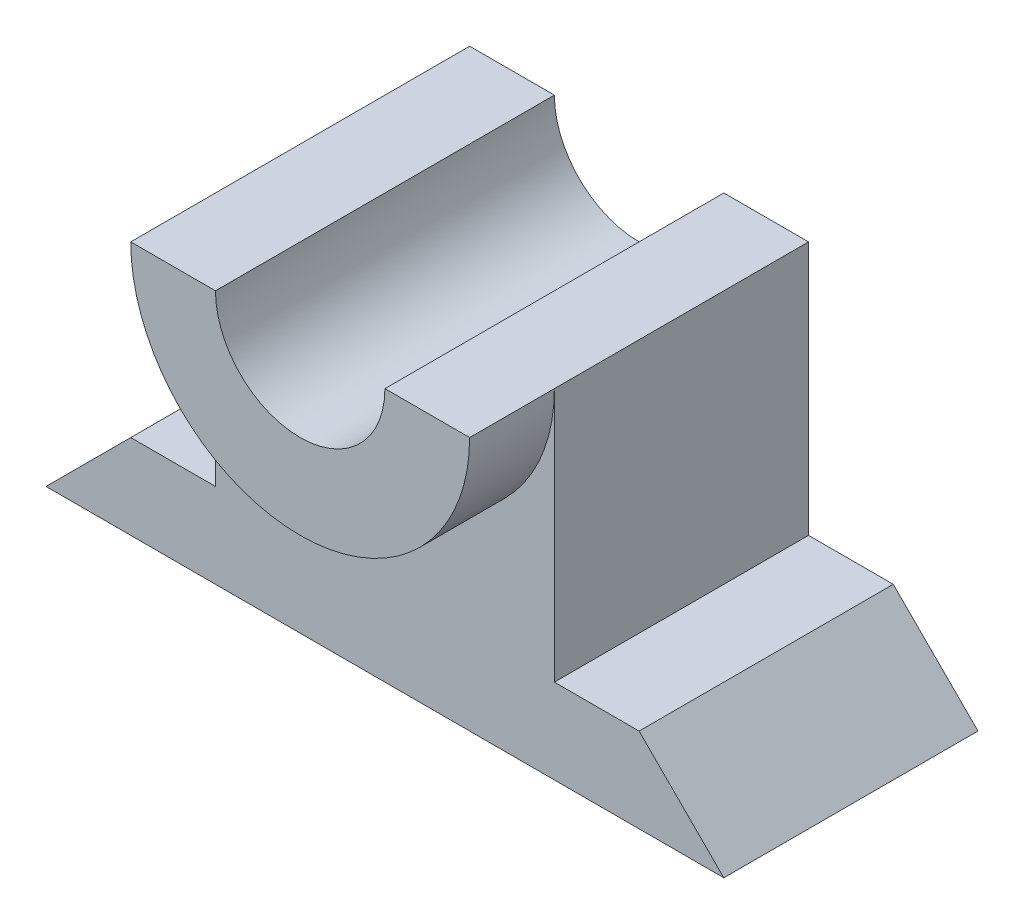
from build123d import *

# Parameters (mm, degrees)
EXTRUDE1_DEPTH = 30
EXTRUDE2_DEPTH = 40


with BuildPart() as part:
    # Sketch1 → Extrude1 (new body)
    with BuildSketch(Plane.XY):
        with BuildLine():
            Line((-40, 0), (0, 0))
            Line((0, 0), (0, 20))
            ThreePointArc((0, 20), (-14.142135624, 25.857864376), (-20, 40))
            Line((-20, 40), (-20, 10))
            Line((-20, 10), (-30, 10))
            Line((-30, 10), (-40, 0))
        make_face()
        with BuildLine():
            Line((0, 0), (40, 0))
            Line((40, 0), (30, 10))
            Line((30, 10), (20, 10))
            Line((20, 10), (20, 40))
            ThreePointArc((20, 40), (14.142135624, 25.857864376), (0, 20))
            Line((0, 20), (0, 0))
        make_face()
        with BuildLine():
            Line((0, 30), (0, 20))
            ThreePointArc((0, 20), (14.142135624, 25.857864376), (20, 40))
            Line((20, 40), (10, 40))
            ThreePointArc((10, 40), (7.071067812, 32.928932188), (0, 30))
        make_face()
        with BuildLine():
            ThreePointArc((-20, 40), (-14.142135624, 25.857864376), (0, 20))
            Line((0, 20), (0, 30))
            ThreePointArc((0, 30), (-7.071067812, 32.928932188), (-10, 40))
            Line((-10, 40), (-20, 40))
        make_face()
    extrude(amount=EXTRUDE1_DEPTH)

    # Sketch → Extrude2 (add)
    with BuildSketch(Plane.XY):
        with BuildLine():
            Line((0, 30), (0, 20))
            ThreePointArc((0, 20), (14.142135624, 25.857864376), (20, 40))
            Line((20, 40), (10, 40))
            ThreePointArc((10, 40), (7.071067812, 32.928932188), (0, 30))
        make_face()
        with BuildLine():
            ThreePointArc((-20, 40), (-14.142135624, 25.857864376), (0, 20))
            Line((0, 20), (0, 30))
            ThreePointArc((0, 30), (-7.071067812, 32.928932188), (-10, 40))
            Line((-10, 40), (-20, 40))
        make_face()
    extrude(amount=EXTRUDE2_DEPTH)


solid = part.part
